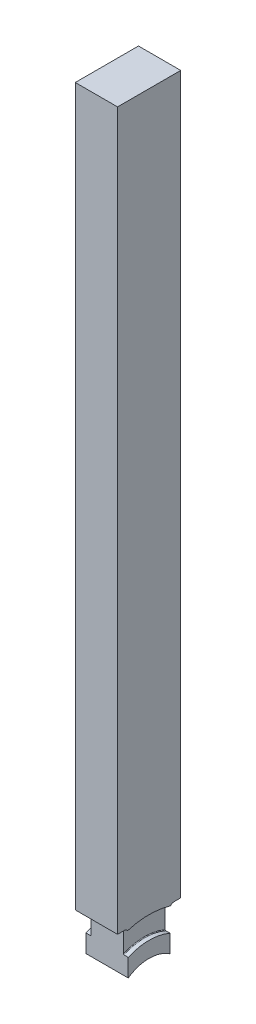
ISO-10303-21;
HEADER;
FILE_DESCRIPTION(('STEP AP214'),'2;1');
FILE_NAME('part.step','',(''),(''),'','','');
FILE_SCHEMA(('AUTOMOTIVE_DESIGN { 1 0 10303 214 1 1 1 1 }'));
ENDSEC;
DATA;
#1=APPLICATION_CONTEXT('core data for automotive mechanical design processes');
#2=APPLICATION_PROTOCOL_DEFINITION('international standard','automotive_design',2000,#1);
#3=PRODUCT_CONTEXT('',#1,'mechanical');
#4=PRODUCT('Part','Part','',(#3));
#5=PRODUCT_RELATED_PRODUCT_CATEGORY('part','',(#4));
#6=PRODUCT_DEFINITION_FORMATION('','',#4);
#7=PRODUCT_DEFINITION_CONTEXT('part definition',#1,'design');
#8=PRODUCT_DEFINITION('design','',#6,#7);
#9=PRODUCT_DEFINITION_SHAPE('','',#8);
#10=(LENGTH_UNIT() NAMED_UNIT(*) SI_UNIT(.MILLI.,.METRE.));
#11=(NAMED_UNIT(*) PLANE_ANGLE_UNIT() SI_UNIT($,.RADIAN.));
#12=(NAMED_UNIT(*) SI_UNIT($,.STERADIAN.) SOLID_ANGLE_UNIT());
#13=UNCERTAINTY_MEASURE_WITH_UNIT(LENGTH_MEASURE(1.E-05),#10,'distance_accuracy_value','');
#14=(GEOMETRIC_REPRESENTATION_CONTEXT(3) GLOBAL_UNCERTAINTY_ASSIGNED_CONTEXT((#13)) GLOBAL_UNIT_ASSIGNED_CONTEXT((#10,
#11,#12)) REPRESENTATION_CONTEXT('',''));
#15=CARTESIAN_POINT('',(0.,0.,0.));
#16=DIRECTION('',(0.,0.,1.));
#17=DIRECTION('',(1.,0.,0.));
#18=AXIS2_PLACEMENT_3D('',#15,#16,#17);
#19=CARTESIAN_POINT('',(12.827,479.425,19.177));
#20=DIRECTION('',(0.,0.,-1.));
#21=DIRECTION('',(0.,1.,0.));
#22=AXIS2_PLACEMENT_3D('',#19,#20,#21);
#23=PLANE('',#22);
#24=DIRECTION('',(0.,-1.,0.));
#25=VECTOR('',#24,1.);
#26=CARTESIAN_POINT('',(-12.827,479.425,19.177));
#27=LINE('',#26,#25);
#28=CARTESIAN_POINT('',(-12.827,479.425,19.177));
#29=VERTEX_POINT('',#28);
#30=CARTESIAN_POINT('',(-12.8270000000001,44.4246,19.177));
#31=VERTEX_POINT('',#30);
#32=EDGE_CURVE('E317',#29,#31,#27,.T.);
#33=ORIENTED_EDGE('',*,*,#32,.T.);
#34=DIRECTION('',(1.,0.,0.));
#35=VECTOR('',#34,1.);
#36=CARTESIAN_POINT('',(12.827,44.4246,19.177));
#37=LINE('',#36,#35);
#38=CARTESIAN_POINT('',(12.8270000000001,44.4246,19.177));
#39=VERTEX_POINT('',#38);
#40=EDGE_CURVE('E284',#31,#39,#37,.T.);
#41=ORIENTED_EDGE('',*,*,#40,.T.);
#42=DIRECTION('',(0.,-1.,0.));
#43=VECTOR('',#42,1.);
#44=CARTESIAN_POINT('',(12.827,479.425,19.177));
#45=LINE('',#44,#43);
#46=CARTESIAN_POINT('',(12.827,479.425,19.177));
#47=VERTEX_POINT('',#46);
#48=EDGE_CURVE('E308',#47,#39,#45,.T.);
#49=ORIENTED_EDGE('',*,*,#48,.F.);
#50=DIRECTION('',(-1.,0.,0.));
#51=VECTOR('',#50,1.);
#52=CARTESIAN_POINT('',(12.827,479.425,19.177));
#53=LINE('',#52,#51);
#54=EDGE_CURVE('E323',#47,#29,#53,.T.);
#55=ORIENTED_EDGE('',*,*,#54,.T.);
#56=EDGE_LOOP('',(#33,#41,#49,#55));
#57=FACE_BOUND('',#56,.T.);
#58=ADVANCED_FACE('F37',(#57),#23,.F.);
#59=CARTESIAN_POINT('',(12.827,479.425,-19.177));
#60=DIRECTION('',(0.,0.,1.));
#61=DIRECTION('',(0.,-1.,0.));
#62=AXIS2_PLACEMENT_3D('',#59,#60,#61);
#63=PLANE('',#62);
#64=DIRECTION('',(0.,1.,0.));
#65=VECTOR('',#64,1.);
#66=CARTESIAN_POINT('',(12.827,479.425,-19.177));
#67=LINE('',#66,#65);
#68=CARTESIAN_POINT('',(12.8270000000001,44.4246,-19.177));
#69=VERTEX_POINT('',#68);
#70=CARTESIAN_POINT('',(12.827,479.425,-19.177));
#71=VERTEX_POINT('',#70);
#72=EDGE_CURVE('E312',#69,#71,#67,.T.);
#73=ORIENTED_EDGE('',*,*,#72,.F.);
#74=DIRECTION('',(-1.,0.,0.));
#75=VECTOR('',#74,1.);
#76=CARTESIAN_POINT('',(12.827,44.4246,-19.177));
#77=LINE('',#76,#75);
#78=CARTESIAN_POINT('',(-12.8270000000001,44.4246,-19.177));
#79=VERTEX_POINT('',#78);
#80=EDGE_CURVE('E196',#69,#79,#77,.T.);
#81=ORIENTED_EDGE('',*,*,#80,.T.);
#82=DIRECTION('',(0.,1.,0.));
#83=VECTOR('',#82,1.);
#84=CARTESIAN_POINT('',(-12.827,479.425,-19.177));
#85=LINE('',#84,#83);
#86=CARTESIAN_POINT('',(-12.827,479.425,-19.177));
#87=VERTEX_POINT('',#86);
#88=EDGE_CURVE('E309',#79,#87,#85,.T.);
#89=ORIENTED_EDGE('',*,*,#88,.T.);
#90=DIRECTION('',(-1.,0.,0.));
#91=VECTOR('',#90,1.);
#92=CARTESIAN_POINT('',(12.827,479.425,-19.177));
#93=LINE('',#92,#91);
#94=EDGE_CURVE('E314',#71,#87,#93,.T.);
#95=ORIENTED_EDGE('',*,*,#94,.F.);
#96=EDGE_LOOP('',(#73,#81,#89,#95));
#97=FACE_BOUND('',#96,.T.);
#98=ADVANCED_FACE('F435',(#97),#63,.F.);
#99=CARTESIAN_POINT('',(12.827,0.,0.));
#100=DIRECTION('',(-1.,0.,0.));
#101=DIRECTION('',(0.,0.,1.));
#102=AXIS2_PLACEMENT_3D('',#99,#100,#101);
#103=PLANE('',#102);
#104=CARTESIAN_POINT('',(12.827,0.,0.));
#105=DIRECTION('',(1.,0.,0.));
#106=DIRECTION('',(0.,0.,-1.));
#107=AXIS2_PLACEMENT_3D('',#104,#105,#106);
#108=CIRCLE('',#107,22.225);
#109=CARTESIAN_POINT('',(12.8270000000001,18.2389864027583,-12.7));
#110=VERTEX_POINT('',#109);
#111=CARTESIAN_POINT('',(12.8270000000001,18.2389864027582,12.7));
#112=VERTEX_POINT('',#111);
#113=EDGE_CURVE('E294',#110,#112,#108,.T.);
#114=ORIENTED_EDGE('',*,*,#113,.F.);
#115=DIRECTION('',(0.,-1.,0.));
#116=VECTOR('',#115,1.);
#117=CARTESIAN_POINT('',(12.8270000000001,0.,-12.7));
#118=LINE('',#117,#116);
#119=CARTESIAN_POINT('',(12.8270000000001,29.0993556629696,-12.7));
#120=VERTEX_POINT('',#119);
#121=EDGE_CURVE('E201',#120,#110,#118,.T.);
#122=ORIENTED_EDGE('',*,*,#121,.F.);
#123=CARTESIAN_POINT('',(12.8270000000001,0.,0.));
#124=DIRECTION('',(-1.,0.,0.));
#125=DIRECTION('',(0.,0.,1.));
#126=AXIS2_PLACEMENT_3D('',#123,#124,#125);
#127=CIRCLE('',#126,31.75);
#128=CARTESIAN_POINT('',(12.8270000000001,29.0993556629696,12.7));
#129=VERTEX_POINT('',#128);
#130=EDGE_CURVE('E290',#129,#120,#127,.T.);
#131=ORIENTED_EDGE('',*,*,#130,.F.);
#132=DIRECTION('',(0.,1.,0.));
#133=VECTOR('',#132,1.);
#134=CARTESIAN_POINT('',(12.8270000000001,0.,12.7));
#135=LINE('',#134,#133);
#136=EDGE_CURVE('E234',#112,#129,#135,.T.);
#137=ORIENTED_EDGE('',*,*,#136,.F.);
#138=EDGE_LOOP('',(#114,#122,#131,#137));
#139=FACE_BOUND('',#138,.T.);
#140=ADVANCED_FACE('F429',(#139),#103,.F.);
#141=CARTESIAN_POINT('',(-12.827,0.,0.));
#142=DIRECTION('',(-1.,0.,0.));
#143=DIRECTION('',(0.,0.,1.));
#144=AXIS2_PLACEMENT_3D('',#141,#142,#143);
#145=PLANE('',#144);
#146=CARTESIAN_POINT('',(-12.8270000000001,42.037,-15.0876));
#147=DIRECTION('',(1.,0.,0.));
#148=DIRECTION('',(0.,0.,1.));
#149=AXIS2_PLACEMENT_3D('',#146,#147,#148);
#150=CIRCLE('',#149,2.3876);
#151=CARTESIAN_POINT('',(-12.8270000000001,44.4246,-15.0876));
#152=VERTEX_POINT('',#151);
#153=CARTESIAN_POINT('',(-12.8270000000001,43.3090510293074,-13.0670753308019));
#154=VERTEX_POINT('',#153);
#155=EDGE_CURVE('E209',#152,#154,#150,.T.);
#156=ORIENTED_EDGE('',*,*,#155,.T.);
#157=CARTESIAN_POINT('',(-12.8270000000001,0.,0.));
#158=DIRECTION('',(-1.,0.,0.));
#159=DIRECTION('',(0.,0.,1.));
#160=AXIS2_PLACEMENT_3D('',#157,#158,#159);
#161=CIRCLE('',#160,45.2374);
#162=CARTESIAN_POINT('',(-12.8270000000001,43.3090510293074,13.0670753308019));
#163=VERTEX_POINT('',#162);
#164=EDGE_CURVE('E291',#163,#154,#161,.T.);
#165=ORIENTED_EDGE('',*,*,#164,.F.);
#166=CARTESIAN_POINT('',(-12.8270000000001,42.037,15.0876));
#167=DIRECTION('',(1.,0.,0.));
#168=DIRECTION('',(0.,0.,-1.));
#169=AXIS2_PLACEMENT_3D('',#166,#167,#168);
#170=CIRCLE('',#169,2.3876);
#171=CARTESIAN_POINT('',(-12.8270000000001,44.4246,15.0876));
#172=VERTEX_POINT('',#171);
#173=EDGE_CURVE('E236',#163,#172,#170,.T.);
#174=ORIENTED_EDGE('',*,*,#173,.T.);
#175=DIRECTION('',(0.,0.,1.));
#176=VECTOR('',#175,1.);
#177=CARTESIAN_POINT('',(-12.8270000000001,44.4246,15.0876));
#178=LINE('',#177,#176);
#179=EDGE_CURVE('E239',#172,#31,#178,.T.);
#180=ORIENTED_EDGE('',*,*,#179,.T.);
#181=ORIENTED_EDGE('',*,*,#32,.F.);
#182=DIRECTION('',(0.,0.,1.));
#183=VECTOR('',#182,1.);
#184=CARTESIAN_POINT('',(-12.827,479.425,19.177));
#185=LINE('',#184,#183);
#186=EDGE_CURVE('E304',#87,#29,#185,.T.);
#187=ORIENTED_EDGE('',*,*,#186,.F.);
#188=ORIENTED_EDGE('',*,*,#88,.F.);
#189=DIRECTION('',(0.,0.,1.));
#190=VECTOR('',#189,1.);
#191=CARTESIAN_POINT('',(-12.8270000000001,44.4246,-15.0876));
#192=LINE('',#191,#190);
#193=EDGE_CURVE('E221',#79,#152,#192,.T.);
#194=ORIENTED_EDGE('',*,*,#193,.T.);
#195=EDGE_LOOP('',(#156,#165,#174,#180,#181,#187,#188,#194));
#196=FACE_BOUND('',#195,.T.);
#197=ADVANCED_FACE('F430',(#196),#145,.T.);
#198=DIRECTION('',(0.,-1.,0.));
#199=VECTOR('',#198,1.);
#200=CARTESIAN_POINT('',(-12.8270000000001,0.,-12.7));
#201=LINE('',#200,#199);
#202=CARTESIAN_POINT('',(-12.8270000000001,29.0993556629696,-12.7));
#203=VERTEX_POINT('',#202);
#204=CARTESIAN_POINT('',(-12.8270000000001,18.2389864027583,-12.7));
#205=VERTEX_POINT('',#204);
#206=EDGE_CURVE('E218',#203,#205,#201,.T.);
#207=ORIENTED_EDGE('',*,*,#206,.T.);
#208=CARTESIAN_POINT('',(-12.827,0.,0.));
#209=DIRECTION('',(1.,0.,0.));
#210=DIRECTION('',(0.,0.,-1.));
#211=AXIS2_PLACEMENT_3D('',#208,#209,#210);
#212=CIRCLE('',#211,22.225);
#213=CARTESIAN_POINT('',(-12.8270000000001,18.2389864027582,12.7));
#214=VERTEX_POINT('',#213);
#215=EDGE_CURVE('E301',#205,#214,#212,.T.);
#216=ORIENTED_EDGE('',*,*,#215,.T.);
#217=DIRECTION('',(0.,1.,0.));
#218=VECTOR('',#217,1.);
#219=CARTESIAN_POINT('',(-12.8270000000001,0.,12.7));
#220=LINE('',#219,#218);
#221=CARTESIAN_POINT('',(-12.8270000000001,29.0993556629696,12.7));
#222=VERTEX_POINT('',#221);
#223=EDGE_CURVE('E242',#214,#222,#220,.T.);
#224=ORIENTED_EDGE('',*,*,#223,.T.);
#225=CARTESIAN_POINT('',(-12.8270000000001,0.,0.));
#226=DIRECTION('',(-1.,0.,0.));
#227=DIRECTION('',(0.,0.,1.));
#228=AXIS2_PLACEMENT_3D('',#225,#226,#227);
#229=CIRCLE('',#228,31.75);
#230=EDGE_CURVE('E288',#222,#203,#229,.T.);
#231=ORIENTED_EDGE('',*,*,#230,.T.);
#232=EDGE_LOOP('',(#207,#216,#224,#231));
#233=FACE_BOUND('',#232,.T.);
#234=ADVANCED_FACE('F433',(#233),#145,.T.);
#235=CARTESIAN_POINT('',(12.827,479.425,19.177));
#236=DIRECTION('',(0.,-1.,0.));
#237=DIRECTION('',(0.,0.,-1.));
#238=AXIS2_PLACEMENT_3D('',#235,#236,#237);
#239=PLANE('',#238);
#240=ORIENTED_EDGE('',*,*,#186,.T.);
#241=ORIENTED_EDGE('',*,*,#54,.F.);
#242=DIRECTION('',(0.,0.,1.));
#243=VECTOR('',#242,1.);
#244=CARTESIAN_POINT('',(12.827,479.425,19.177));
#245=LINE('',#244,#243);
#246=EDGE_CURVE('E305',#71,#47,#245,.T.);
#247=ORIENTED_EDGE('',*,*,#246,.F.);
#248=ORIENTED_EDGE('',*,*,#94,.T.);
#249=EDGE_LOOP('',(#240,#241,#247,#248));
#250=FACE_BOUND('',#249,.T.);
#251=ADVANCED_FACE('F368',(#250),#239,.F.);
#252=CARTESIAN_POINT('',(12.8270000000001,0.,0.));
#253=DIRECTION('',(-1.,0.,0.));
#254=DIRECTION('',(0.,0.,1.));
#255=AXIS2_PLACEMENT_3D('',#252,#253,#254);
#256=CIRCLE('',#255,45.2374);
#257=CARTESIAN_POINT('',(12.8270000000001,43.3090510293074,13.0670753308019));
#258=VERTEX_POINT('',#257);
#259=CARTESIAN_POINT('',(12.8270000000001,43.3090510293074,-13.0670753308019));
#260=VERTEX_POINT('',#259);
#261=EDGE_CURVE('E217',#258,#260,#256,.T.);
#262=ORIENTED_EDGE('',*,*,#261,.T.);
#263=CARTESIAN_POINT('',(12.8270000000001,42.037,-15.0876));
#264=DIRECTION('',(1.,0.,0.));
#265=DIRECTION('',(0.,0.,1.));
#266=AXIS2_PLACEMENT_3D('',#263,#264,#265);
#267=CIRCLE('',#266,2.3876);
#268=CARTESIAN_POINT('',(12.8270000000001,44.4246,-15.0876));
#269=VERTEX_POINT('',#268);
#270=EDGE_CURVE('E200',#269,#260,#267,.T.);
#271=ORIENTED_EDGE('',*,*,#270,.F.);
#272=DIRECTION('',(0.,0.,1.));
#273=VECTOR('',#272,1.);
#274=CARTESIAN_POINT('',(12.8270000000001,44.4246,-15.0876));
#275=LINE('',#274,#273);
#276=EDGE_CURVE('E190',#69,#269,#275,.T.);
#277=ORIENTED_EDGE('',*,*,#276,.F.);
#278=ORIENTED_EDGE('',*,*,#72,.T.);
#279=ORIENTED_EDGE('',*,*,#246,.T.);
#280=ORIENTED_EDGE('',*,*,#48,.T.);
#281=DIRECTION('',(0.,0.,1.));
#282=VECTOR('',#281,1.);
#283=CARTESIAN_POINT('',(12.8270000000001,44.4246,15.0876));
#284=LINE('',#283,#282);
#285=CARTESIAN_POINT('',(12.8270000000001,44.4246,15.0876));
#286=VERTEX_POINT('',#285);
#287=EDGE_CURVE('E232',#286,#39,#284,.T.);
#288=ORIENTED_EDGE('',*,*,#287,.F.);
#289=CARTESIAN_POINT('',(12.8270000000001,42.037,15.0876));
#290=DIRECTION('',(1.,0.,0.));
#291=DIRECTION('',(0.,0.,-1.));
#292=AXIS2_PLACEMENT_3D('',#289,#290,#291);
#293=CIRCLE('',#292,2.3876);
#294=EDGE_CURVE('E230',#258,#286,#293,.T.);
#295=ORIENTED_EDGE('',*,*,#294,.F.);
#296=EDGE_LOOP('',(#262,#271,#277,#278,#279,#280,#288,#295));
#297=FACE_BOUND('',#296,.T.);
#298=ADVANCED_FACE('F214',(#297),#103,.F.);
#299=CARTESIAN_POINT('',(-12.827,0.,0.));
#300=DIRECTION('',(1.,0.,0.));
#301=DIRECTION('',(0.,0.,-1.));
#302=AXIS2_PLACEMENT_3D('',#299,#300,#301);
#303=CYLINDRICAL_SURFACE('',#302,22.225);
#304=ORIENTED_EDGE('',*,*,#215,.F.);
#305=DIRECTION('',(1.,0.,0.));
#306=VECTOR('',#305,1.);
#307=CARTESIAN_POINT('',(-12.827,18.2389864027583,-12.7));
#308=LINE('',#307,#306);
#309=EDGE_CURVE('E281',#205,#110,#308,.T.);
#310=ORIENTED_EDGE('',*,*,#309,.T.);
#311=ORIENTED_EDGE('',*,*,#113,.T.);
#312=DIRECTION('',(1.,0.,0.));
#313=VECTOR('',#312,1.);
#314=CARTESIAN_POINT('',(-12.827,18.2389864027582,12.7));
#315=LINE('',#314,#313);
#316=EDGE_CURVE('E271',#112,#214,#315,.F.);
#317=ORIENTED_EDGE('',*,*,#316,.T.);
#318=EDGE_LOOP('',(#304,#310,#311,#317));
#319=FACE_BOUND('',#318,.T.);
#320=ADVANCED_FACE('F416',(#319),#303,.F.);
#321=CARTESIAN_POINT('',(-9.85520000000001,31.75,0.));
#322=DIRECTION('',(-1.,0.,0.));
#323=DIRECTION('',(0.,0.,1.));
#324=AXIS2_PLACEMENT_3D('',#321,#322,#323);
#325=PLANE('',#324);
#326=DIRECTION('',(0.,1.,0.));
#327=VECTOR('',#326,1.);
#328=CARTESIAN_POINT('',(-9.85520000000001,31.75,-12.7));
#329=LINE('',#328,#327);
#330=CARTESIAN_POINT('',(-9.85520000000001,29.5145923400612,-12.7));
#331=VERTEX_POINT('',#330);
#332=CARTESIAN_POINT('',(-9.85520000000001,42.037,-12.7));
#333=VERTEX_POINT('',#332);
#334=EDGE_CURVE('E279',#331,#333,#329,.T.);
#335=ORIENTED_EDGE('',*,*,#334,.F.);
#336=CARTESIAN_POINT('',(-9.85520000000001,0.,0.));
#337=DIRECTION('',(-1.,0.,0.));
#338=DIRECTION('',(0.,0.,1.));
#339=AXIS2_PLACEMENT_3D('',#336,#337,#338);
#340=CIRCLE('',#339,32.131);
#341=CARTESIAN_POINT('',(-9.85520000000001,29.5145923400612,12.7));
#342=VERTEX_POINT('',#341);
#343=EDGE_CURVE('E474',#331,#342,#340,.F.);
#344=ORIENTED_EDGE('',*,*,#343,.T.);
#345=DIRECTION('',(0.,-1.,0.));
#346=VECTOR('',#345,1.);
#347=CARTESIAN_POINT('',(-9.85520000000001,31.75,12.7));
#348=LINE('',#347,#346);
#349=CARTESIAN_POINT('',(-9.85520000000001,42.037,12.7));
#350=VERTEX_POINT('',#349);
#351=EDGE_CURVE('E268',#350,#342,#348,.T.);
#352=ORIENTED_EDGE('',*,*,#351,.F.);
#353=CARTESIAN_POINT('',(-9.85520000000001,42.037,15.0876));
#354=DIRECTION('',(-1.,0.,0.));
#355=DIRECTION('',(0.,0.,1.));
#356=AXIS2_PLACEMENT_3D('',#353,#354,#355);
#357=CIRCLE('',#356,2.3876);
#358=CARTESIAN_POINT('',(-9.85520000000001,42.6032439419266,12.7681169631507));
#359=VERTEX_POINT('',#358);
#360=EDGE_CURVE('E256',#359,#350,#357,.T.);
#361=ORIENTED_EDGE('',*,*,#360,.F.);
#362=CARTESIAN_POINT('',(-9.85520000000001,0.,0.));
#363=DIRECTION('',(-1.,0.,0.));
#364=DIRECTION('',(0.,0.,1.));
#365=AXIS2_PLACEMENT_3D('',#362,#363,#364);
#366=CIRCLE('',#365,44.4754);
#367=CARTESIAN_POINT('',(-9.85520000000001,42.6032439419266,-12.7681169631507));
#368=VERTEX_POINT('',#367);
#369=EDGE_CURVE('E334',#359,#368,#366,.T.);
#370=ORIENTED_EDGE('',*,*,#369,.T.);
#371=CARTESIAN_POINT('',(-9.85520000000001,42.037,-15.0876));
#372=DIRECTION('',(-1.,0.,0.));
#373=DIRECTION('',(0.,0.,1.));
#374=AXIS2_PLACEMENT_3D('',#371,#372,#373);
#375=CIRCLE('',#374,2.3876);
#376=EDGE_CURVE('E262',#333,#368,#375,.T.);
#377=ORIENTED_EDGE('',*,*,#376,.F.);
#378=EDGE_LOOP('',(#335,#344,#352,#361,#370,#377));
#379=FACE_BOUND('',#378,.T.);
#380=ADVANCED_FACE('F412',(#379),#325,.T.);
#381=CARTESIAN_POINT('',(-8.84822894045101,0.,0.));
#382=DIRECTION('',(-1.,0.,0.));
#383=DIRECTION('',(0.,0.,1.));
#384=AXIS2_PLACEMENT_3D('',#381,#382,#383);
#385=CYLINDRICAL_SURFACE('',#384,45.2374);
#386=DIRECTION('',(1.,0.,0.));
#387=VECTOR('',#386,1.);
#388=CARTESIAN_POINT('',(-11.3411,43.3090510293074,-13.0670753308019));
#389=LINE('',#388,#387);
#390=CARTESIAN_POINT('',(-10.6172,43.3090510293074,-13.0670753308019));
#391=VERTEX_POINT('',#390);
#392=EDGE_CURVE('E260',#391,#154,#389,.F.);
#393=ORIENTED_EDGE('',*,*,#392,.F.);
#394=CARTESIAN_POINT('',(-10.6172,0.,0.));
#395=DIRECTION('',(-1.,0.,0.));
#396=DIRECTION('',(0.,0.,1.));
#397=AXIS2_PLACEMENT_3D('',#394,#395,#396);
#398=CIRCLE('',#397,45.2374);
#399=CARTESIAN_POINT('',(-10.6172,43.3090510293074,13.0670753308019));
#400=VERTEX_POINT('',#399);
#401=EDGE_CURVE('E337',#391,#400,#398,.F.);
#402=ORIENTED_EDGE('',*,*,#401,.T.);
#403=DIRECTION('',(1.,0.,0.));
#404=VECTOR('',#403,1.);
#405=CARTESIAN_POINT('',(-11.3411,43.3090510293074,13.0670753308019));
#406=LINE('',#405,#404);
#407=EDGE_CURVE('E253',#163,#400,#406,.T.);
#408=ORIENTED_EDGE('',*,*,#407,.F.);
#409=ORIENTED_EDGE('',*,*,#164,.T.);
#410=EDGE_LOOP('',(#393,#402,#408,#409));
#411=FACE_BOUND('',#410,.T.);
#412=ADVANCED_FACE('F415',(#411),#385,.F.);
#413=CARTESIAN_POINT('',(-8.84822894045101,0.,0.));
#414=DIRECTION('',(-1.,0.,0.));
#415=DIRECTION('',(0.,0.,1.));
#416=AXIS2_PLACEMENT_3D('',#413,#414,#415);
#417=CYLINDRICAL_SURFACE('',#416,31.75);
#418=DIRECTION('',(-1.,0.,0.));
#419=VECTOR('',#418,1.);
#420=CARTESIAN_POINT('',(-8.84822894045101,29.0993556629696,12.7));
#421=LINE('',#420,#419);
#422=CARTESIAN_POINT('',(-10.2362,29.0993556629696,12.7));
#423=VERTEX_POINT('',#422);
#424=EDGE_CURVE('E266',#423,#222,#421,.T.);
#425=ORIENTED_EDGE('',*,*,#424,.F.);
#426=CARTESIAN_POINT('',(-10.2362,0.,0.));
#427=DIRECTION('',(-1.,0.,0.));
#428=DIRECTION('',(0.,0.,1.));
#429=AXIS2_PLACEMENT_3D('',#426,#427,#428);
#430=CIRCLE('',#429,31.75);
#431=CARTESIAN_POINT('',(-10.2362,29.0993556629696,-12.7));
#432=VERTEX_POINT('',#431);
#433=EDGE_CURVE('E389',#423,#432,#430,.T.);
#434=ORIENTED_EDGE('',*,*,#433,.T.);
#435=DIRECTION('',(-1.,0.,0.));
#436=VECTOR('',#435,1.);
#437=CARTESIAN_POINT('',(-8.84822894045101,29.0993556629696,-12.7));
#438=LINE('',#437,#436);
#439=EDGE_CURVE('E276',#203,#432,#438,.F.);
#440=ORIENTED_EDGE('',*,*,#439,.F.);
#441=ORIENTED_EDGE('',*,*,#230,.F.);
#442=EDGE_LOOP('',(#425,#434,#440,#441));
#443=FACE_BOUND('',#442,.T.);
#444=ADVANCED_FACE('F408',(#443),#417,.T.);
#445=CARTESIAN_POINT('',(9.8552,31.75,0.));
#446=DIRECTION('',(1.,0.,0.));
#447=DIRECTION('',(0.,0.,-1.));
#448=AXIS2_PLACEMENT_3D('',#445,#446,#447);
#449=PLANE('',#448);
#450=DIRECTION('',(0.,1.,0.));
#451=VECTOR('',#450,1.);
#452=CARTESIAN_POINT('',(9.8552,31.75,12.7));
#453=LINE('',#452,#451);
#454=CARTESIAN_POINT('',(9.8552,29.5145923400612,12.7));
#455=VERTEX_POINT('',#454);
#456=CARTESIAN_POINT('',(9.8552,42.037,12.7));
#457=VERTEX_POINT('',#456);
#458=EDGE_CURVE('E264',#455,#457,#453,.T.);
#459=ORIENTED_EDGE('',*,*,#458,.F.);
#460=CARTESIAN_POINT('',(9.8552,0.,0.));
#461=DIRECTION('',(1.,0.,0.));
#462=DIRECTION('',(0.,0.,-1.));
#463=AXIS2_PLACEMENT_3D('',#460,#461,#462);
#464=CIRCLE('',#463,32.131);
#465=CARTESIAN_POINT('',(9.8552,29.5145923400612,-12.7));
#466=VERTEX_POINT('',#465);
#467=EDGE_CURVE('E470',#455,#466,#464,.F.);
#468=ORIENTED_EDGE('',*,*,#467,.T.);
#469=DIRECTION('',(0.,-1.,0.));
#470=VECTOR('',#469,1.);
#471=CARTESIAN_POINT('',(9.8552,31.75,-12.7));
#472=LINE('',#471,#470);
#473=CARTESIAN_POINT('',(9.8552,42.037,-12.7));
#474=VERTEX_POINT('',#473);
#475=EDGE_CURVE('E274',#474,#466,#472,.T.);
#476=ORIENTED_EDGE('',*,*,#475,.F.);
#477=CARTESIAN_POINT('',(9.8552,42.037,-15.0876));
#478=DIRECTION('',(1.,0.,0.));
#479=DIRECTION('',(0.,0.,-1.));
#480=AXIS2_PLACEMENT_3D('',#477,#478,#479);
#481=CIRCLE('',#480,2.3876);
#482=CARTESIAN_POINT('',(9.8552,42.6032439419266,-12.7681169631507));
#483=VERTEX_POINT('',#482);
#484=EDGE_CURVE('E258',#483,#474,#481,.T.);
#485=ORIENTED_EDGE('',*,*,#484,.F.);
#486=CARTESIAN_POINT('',(9.8552,0.,0.));
#487=DIRECTION('',(1.,0.,0.));
#488=DIRECTION('',(0.,0.,-1.));
#489=AXIS2_PLACEMENT_3D('',#486,#487,#488);
#490=CIRCLE('',#489,44.4754);
#491=CARTESIAN_POINT('',(9.8552,42.6032439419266,12.7681169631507));
#492=VERTEX_POINT('',#491);
#493=EDGE_CURVE('E342',#483,#492,#490,.T.);
#494=ORIENTED_EDGE('',*,*,#493,.T.);
#495=CARTESIAN_POINT('',(9.8552,42.037,15.0876));
#496=DIRECTION('',(1.,0.,0.));
#497=DIRECTION('',(0.,0.,-1.));
#498=AXIS2_PLACEMENT_3D('',#495,#496,#497);
#499=CIRCLE('',#498,2.3876);
#500=EDGE_CURVE('E228',#457,#492,#499,.T.);
#501=ORIENTED_EDGE('',*,*,#500,.F.);
#502=EDGE_LOOP('',(#459,#468,#476,#485,#494,#501));
#503=FACE_BOUND('',#502,.T.);
#504=ADVANCED_FACE('F405',(#503),#449,.T.);
#505=CARTESIAN_POINT('',(-8.84822894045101,0.,0.));
#506=DIRECTION('',(-1.,0.,0.));
#507=DIRECTION('',(0.,0.,1.));
#508=AXIS2_PLACEMENT_3D('',#505,#506,#507);
#509=CYLINDRICAL_SURFACE('',#508,31.75);
#510=DIRECTION('',(-1.,0.,0.));
#511=VECTOR('',#510,1.);
#512=CARTESIAN_POINT('',(-8.84822894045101,29.0993556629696,-12.7));
#513=LINE('',#512,#511);
#514=CARTESIAN_POINT('',(10.2362,29.0993556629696,-12.7));
#515=VERTEX_POINT('',#514);
#516=EDGE_CURVE('E332',#515,#120,#513,.F.);
#517=ORIENTED_EDGE('',*,*,#516,.F.);
#518=CARTESIAN_POINT('',(10.2362,0.,0.));
#519=DIRECTION('',(1.,0.,0.));
#520=DIRECTION('',(0.,0.,-1.));
#521=AXIS2_PLACEMENT_3D('',#518,#519,#520);
#522=CIRCLE('',#521,31.75);
#523=CARTESIAN_POINT('',(10.2362,29.0993556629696,12.7));
#524=VERTEX_POINT('',#523);
#525=EDGE_CURVE('E58',#515,#524,#522,.T.);
#526=ORIENTED_EDGE('',*,*,#525,.T.);
#527=DIRECTION('',(-1.,0.,0.));
#528=VECTOR('',#527,1.);
#529=CARTESIAN_POINT('',(-8.84822894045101,29.0993556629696,12.7));
#530=LINE('',#529,#528);
#531=EDGE_CURVE('E330',#129,#524,#530,.T.);
#532=ORIENTED_EDGE('',*,*,#531,.F.);
#533=ORIENTED_EDGE('',*,*,#130,.T.);
#534=EDGE_LOOP('',(#517,#526,#532,#533));
#535=FACE_BOUND('',#534,.T.);
#536=ADVANCED_FACE('F403',(#535),#509,.T.);
#537=CARTESIAN_POINT('',(-8.84822894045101,0.,0.));
#538=DIRECTION('',(-1.,0.,0.));
#539=DIRECTION('',(0.,0.,1.));
#540=AXIS2_PLACEMENT_3D('',#537,#538,#539);
#541=CYLINDRICAL_SURFACE('',#540,45.2374);
#542=DIRECTION('',(1.,0.,0.));
#543=VECTOR('',#542,1.);
#544=CARTESIAN_POINT('',(0.,43.3090510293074,13.0670753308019));
#545=LINE('',#544,#543);
#546=CARTESIAN_POINT('',(10.6172,43.3090510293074,13.0670753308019));
#547=VERTEX_POINT('',#546);
#548=EDGE_CURVE('E326',#547,#258,#545,.T.);
#549=ORIENTED_EDGE('',*,*,#548,.F.);
#550=CARTESIAN_POINT('',(10.6172,0.,0.));
#551=DIRECTION('',(1.,0.,0.));
#552=DIRECTION('',(0.,0.,-1.));
#553=AXIS2_PLACEMENT_3D('',#550,#551,#552);
#554=CIRCLE('',#553,45.2374);
#555=CARTESIAN_POINT('',(10.6172,43.3090510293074,-13.0670753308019));
#556=VERTEX_POINT('',#555);
#557=EDGE_CURVE('E339',#547,#556,#554,.F.);
#558=ORIENTED_EDGE('',*,*,#557,.T.);
#559=DIRECTION('',(1.,0.,0.));
#560=VECTOR('',#559,1.);
#561=CARTESIAN_POINT('',(0.,43.3090510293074,-13.0670753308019));
#562=LINE('',#561,#560);
#563=EDGE_CURVE('E328',#260,#556,#562,.F.);
#564=ORIENTED_EDGE('',*,*,#563,.F.);
#565=ORIENTED_EDGE('',*,*,#261,.F.);
#566=EDGE_LOOP('',(#549,#558,#564,#565));
#567=FACE_BOUND('',#566,.T.);
#568=ADVANCED_FACE('F399',(#567),#541,.F.);
#569=CARTESIAN_POINT('',(-12.8270000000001,44.4246,15.0876));
#570=DIRECTION('',(0.,1.,0.));
#571=DIRECTION('',(0.,0.,1.));
#572=AXIS2_PLACEMENT_3D('',#569,#570,#571);
#573=PLANE('',#572);
#574=ORIENTED_EDGE('',*,*,#179,.F.);
#575=DIRECTION('',(1.,0.,0.));
#576=VECTOR('',#575,1.);
#577=CARTESIAN_POINT('',(-12.8270000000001,44.4246,15.0876));
#578=LINE('',#577,#576);
#579=EDGE_CURVE('E245',#172,#286,#578,.T.);
#580=ORIENTED_EDGE('',*,*,#579,.T.);
#581=ORIENTED_EDGE('',*,*,#287,.T.);
#582=ORIENTED_EDGE('',*,*,#40,.F.);
#583=EDGE_LOOP('',(#574,#580,#581,#582));
#584=FACE_BOUND('',#583,.T.);
#585=ADVANCED_FACE('F398',(#584),#573,.F.);
#586=CARTESIAN_POINT('',(-12.8270000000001,0.,12.7));
#587=DIRECTION('',(0.,0.,-1.));
#588=DIRECTION('',(0.,1.,0.));
#589=AXIS2_PLACEMENT_3D('',#586,#587,#588);
#590=PLANE('',#589);
#591=ORIENTED_EDGE('',*,*,#136,.T.);
#592=ORIENTED_EDGE('',*,*,#531,.T.);
#593=CARTESIAN_POINT('',(10.2362,29.0993556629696,12.7));
#594=CARTESIAN_POINT('',(10.2160442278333,29.0993303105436,12.7));
#595=CARTESIAN_POINT('',(10.1959043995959,29.1010990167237,12.7));
#596=CARTESIAN_POINT('',(10.1562770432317,29.1080244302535,12.7));
#597=CARTESIAN_POINT('',(10.1367877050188,29.1131707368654,12.7));
#598=CARTESIAN_POINT('',(10.0989580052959,29.1266510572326,12.7));
#599=CARTESIAN_POINT('',(10.0806172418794,29.1349839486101,12.7));
#600=CARTESIAN_POINT('',(10.0455248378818,29.154510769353,12.7));
#601=CARTESIAN_POINT('',(10.0287739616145,29.1657060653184,12.7));
#602=CARTESIAN_POINT('',(9.99668843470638,29.1910002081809,12.7));
#603=CARTESIAN_POINT('',(9.98142212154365,29.2051855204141,12.7));
#604=CARTESIAN_POINT('',(9.95327515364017,29.2357483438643,12.7));
#605=CARTESIAN_POINT('',(9.94039510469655,29.2521264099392,12.7));
#606=CARTESIAN_POINT('',(9.91630689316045,29.2879834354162,12.7));
#607=CARTESIAN_POINT('',(9.90531143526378,29.3076051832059,12.7));
#608=CARTESIAN_POINT('',(9.88649650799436,29.3483221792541,12.7));
#609=CARTESIAN_POINT('',(9.87867867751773,29.3694181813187,12.7));
#610=CARTESIAN_POINT('',(9.86674874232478,29.4110601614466,12.7));
#611=CARTESIAN_POINT('',(9.86241896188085,29.4315443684,12.7));
#612=CARTESIAN_POINT('',(9.85664464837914,29.472883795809,12.7));
#613=CARTESIAN_POINT('',(9.85519568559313,29.4937383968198,12.7));
#614=CARTESIAN_POINT('',(9.8552,29.5145923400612,12.7));
#615=B_SPLINE_CURVE_WITH_KNOTS('',3,(#593,#594,#595,#596,#597,#598,#599,#600,#601,#602,#603,
#604,#605,#606,#607,#608,#609,#610,#611,#612,#613,#614),.UNSPECIFIED.,.F.,.F.,(4,2,2,2,2,2,2,2,
2,2,4),(0.,0.0603650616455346,0.120545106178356,0.180703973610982,0.240891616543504,
0.303144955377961,0.365414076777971,0.432606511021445,0.499833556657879,0.562442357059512,
0.624954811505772),.UNSPECIFIED.);
#616=EDGE_CURVE('E11',#524,#455,#615,.T.);
#617=ORIENTED_EDGE('',*,*,#616,.T.);
#618=ORIENTED_EDGE('',*,*,#458,.T.);
#619=DIRECTION('',(1.,0.,0.));
#620=VECTOR('',#619,1.);
#621=CARTESIAN_POINT('',(-12.8270000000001,42.037,12.7));
#622=LINE('',#621,#620);
#623=EDGE_CURVE('E246',#350,#457,#622,.T.);
#624=ORIENTED_EDGE('',*,*,#623,.F.);
#625=ORIENTED_EDGE('',*,*,#351,.T.);
#626=CARTESIAN_POINT('',(-9.85520000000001,29.5145923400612,12.7));
#627=CARTESIAN_POINT('',(-9.85518967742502,29.4896301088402,12.7));
#628=CARTESIAN_POINT('',(-9.85726978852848,29.4646614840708,12.7));
#629=CARTESIAN_POINT('',(-9.86554425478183,29.4153652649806,12.7));
#630=CARTESIAN_POINT('',(-9.87174683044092,29.3910390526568,12.7));
#631=CARTESIAN_POINT('',(-9.88821000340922,29.3437555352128,12.7));
#632=CARTESIAN_POINT('',(-9.89847598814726,29.3208000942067,12.7));
#633=CARTESIAN_POINT('',(-9.92288445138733,29.2770659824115,12.7));
#634=CARTESIAN_POINT('',(-9.93702329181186,29.2562852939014,12.7));
#635=CARTESIAN_POINT('',(-9.96816546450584,29.2185435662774,12.7));
#636=CARTESIAN_POINT('',(-9.9850106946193,29.201452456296,12.7));
#637=CARTESIAN_POINT('',(-10.0215723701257,29.1706560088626,12.7));
#638=CARTESIAN_POINT('',(-10.0412883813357,29.1569501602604,12.7));
#639=CARTESIAN_POINT('',(-10.0812215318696,29.1345759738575,12.7));
#640=CARTESIAN_POINT('',(-10.1012553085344,29.1255796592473,12.7));
#641=CARTESIAN_POINT('',(-10.1426125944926,29.1114017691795,12.7));
#642=CARTESIAN_POINT('',(-10.1639335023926,29.106212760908,12.7));
#643=CARTESIAN_POINT('',(-10.1939164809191,29.1018194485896,12.7));
#644=CARTESIAN_POINT('',(-10.2023531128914,29.100895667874,12.7));
#645=CARTESIAN_POINT('',(-10.2192583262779,29.0996644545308,12.7));
#646=CARTESIAN_POINT('',(-10.2277268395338,29.0993560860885,12.7));
#647=CARTESIAN_POINT('',(-10.2362,29.0993556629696,12.7));
#648=B_SPLINE_CURVE_WITH_KNOTS('',3,(#626,#627,#628,#629,#630,#631,#632,#633,#634,#635,#636,
#637,#638,#639,#640,#641,#642,#643,#644,#645,#646,#647),.UNSPECIFIED.,.F.,.F.,(4,2,2,2,2,2,2,2,
2,2,4),(0.,0.0748119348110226,0.14977349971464,0.224834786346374,0.29982580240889,
0.371431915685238,0.443027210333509,0.508568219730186,0.573980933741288,0.599424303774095,
0.624828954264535),.UNSPECIFIED.);
#649=EDGE_CURVE('E485',#342,#423,#648,.T.);
#650=ORIENTED_EDGE('',*,*,#649,.T.);
#651=ORIENTED_EDGE('',*,*,#424,.T.);
#652=ORIENTED_EDGE('',*,*,#223,.F.);
#653=ORIENTED_EDGE('',*,*,#316,.F.);
#654=EDGE_LOOP('',(#591,#592,#617,#618,#624,#625,#650,#651,#652,#653));
#655=FACE_BOUND('',#654,.T.);
#656=ADVANCED_FACE('F396',(#655),#590,.F.);
#657=CARTESIAN_POINT('',(-12.8270000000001,42.037,15.0876));
#658=DIRECTION('',(1.,0.,0.));
#659=DIRECTION('',(0.,0.,-1.));
#660=AXIS2_PLACEMENT_3D('',#657,#658,#659);
#661=CYLINDRICAL_SURFACE('',#660,2.3876);
#662=ORIENTED_EDGE('',*,*,#407,.T.);
#663=CARTESIAN_POINT('',(-10.6172,43.3090510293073,13.0670753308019));
#664=CARTESIAN_POINT('',(-10.5750852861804,43.3090762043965,13.067128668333));
#665=CARTESIAN_POINT('',(-10.5330005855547,43.3059886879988,13.0651476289));
#666=CARTESIAN_POINT('',(-10.4501486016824,43.2937934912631,13.0575273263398));
#667=CARTESIAN_POINT('',(-10.4093784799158,43.284699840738,13.0518965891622));
#668=CARTESIAN_POINT('',(-10.330213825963,43.2606982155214,13.0373853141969));
#669=CARTESIAN_POINT('',(-10.2918188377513,43.2457913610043,13.0285054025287));
#670=CARTESIAN_POINT('',(-10.2183687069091,43.2104834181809,13.0081801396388));
#671=CARTESIAN_POINT('',(-10.183314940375,43.1900800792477,12.9967337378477));
#672=CARTESIAN_POINT('',(-10.1166760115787,43.1436452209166,12.971783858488));
#673=CARTESIAN_POINT('',(-10.0851881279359,43.1174960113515,12.9582394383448));
#674=CARTESIAN_POINT('',(-10.0274480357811,43.0603611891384,12.9301995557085));
#675=CARTESIAN_POINT('',(-10.0011964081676,43.0293750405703,12.915703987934));
#676=CARTESIAN_POINT('',(-9.95444566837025,42.9628880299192,12.8865334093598));
#677=CARTESIAN_POINT('',(-9.93400466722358,42.9273463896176,12.8718580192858));
#678=CARTESIAN_POINT('',(-9.89988117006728,42.852853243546,12.8433623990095));
#679=CARTESIAN_POINT('',(-9.88619307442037,42.8139045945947,12.8295414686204));
#680=CARTESIAN_POINT('',(-9.86916777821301,42.7462019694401,12.8075759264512));
#681=CARTESIAN_POINT('',(-9.86393487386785,42.7180484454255,12.7990035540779));
#682=CARTESIAN_POINT('',(-9.85694771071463,42.6610617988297,12.7828074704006));
#683=CARTESIAN_POINT('',(-9.85519166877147,42.632229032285,12.7751832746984));
#684=CARTESIAN_POINT('',(-9.85520000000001,42.6032439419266,12.7681169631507));
#685=B_SPLINE_CURVE_WITH_KNOTS('',3,(#663,#664,#665,#666,#667,#668,#669,#670,#671,#672,#673,
#674,#675,#676,#677,#678,#679,#680,#681,#682,#683,#684),.UNSPECIFIED.,.F.,.F.,(4,2,2,2,2,2,2,2,
2,2,4),(0.,0.126138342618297,0.251983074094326,0.377803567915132,0.503675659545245,
0.632416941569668,0.761172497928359,0.891173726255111,1.02106697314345,1.11052787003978,
1.19994287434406),.UNSPECIFIED.);
#686=EDGE_CURVE('E352',#400,#359,#685,.T.);
#687=ORIENTED_EDGE('',*,*,#686,.T.);
#688=ORIENTED_EDGE('',*,*,#360,.T.);
#689=ORIENTED_EDGE('',*,*,#623,.T.);
#690=ORIENTED_EDGE('',*,*,#500,.T.);
#691=CARTESIAN_POINT('',(9.8552,42.6032439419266,12.7681169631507));
#692=CARTESIAN_POINT('',(9.85515687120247,42.6435021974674,12.7779044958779));
#693=CARTESIAN_POINT('',(9.85856700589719,42.6834639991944,12.7888093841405));
#694=CARTESIAN_POINT('',(9.87201485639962,42.7616509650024,12.8122700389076));
#695=CARTESIAN_POINT('',(9.88203664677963,42.7998800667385,12.824821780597));
#696=CARTESIAN_POINT('',(9.90843148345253,42.8736619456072,12.8510448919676));
#697=CARTESIAN_POINT('',(9.92480466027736,42.9092146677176,12.8647162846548));
#698=CARTESIAN_POINT('',(9.96339947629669,42.9768274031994,12.8924481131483));
#699=CARTESIAN_POINT('',(9.98562308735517,43.0088862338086,12.9065086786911));
#700=CARTESIAN_POINT('',(10.0358506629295,43.0694967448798,12.9345265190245));
#701=CARTESIAN_POINT('',(10.0639697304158,43.0979570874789,12.9484749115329));
#702=CARTESIAN_POINT('',(10.1249490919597,43.1499962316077,12.975082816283));
#703=CARTESIAN_POINT('',(10.1578107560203,43.1735736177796,12.9877419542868));
#704=CARTESIAN_POINT('',(10.228462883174,43.216002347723,13.0112583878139));
#705=CARTESIAN_POINT('',(10.2663685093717,43.2346970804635,13.0220528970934));
#706=CARTESIAN_POINT('',(10.3452970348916,43.2660277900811,13.040539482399));
#707=CARTESIAN_POINT('',(10.3863175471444,43.278668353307,13.0482339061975));
#708=CARTESIAN_POINT('',(10.4590827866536,43.2950744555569,13.0583264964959));
#709=CARTESIAN_POINT('',(10.4903864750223,43.3003073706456,13.0615896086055));
#710=CARTESIAN_POINT('',(10.5535205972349,43.3072982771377,13.0659718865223));
#711=CARTESIAN_POINT('',(10.5853509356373,43.3090568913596,13.0670914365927));
#712=CARTESIAN_POINT('',(10.6172,43.3090510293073,13.0670753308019));
#713=B_SPLINE_CURVE_WITH_KNOTS('',3,(#691,#692,#693,#694,#695,#696,#697,#698,#699,#700,#701,
#702,#703,#704,#705,#706,#707,#708,#709,#710,#711,#712),.UNSPECIFIED.,.F.,.F.,(4,2,2,2,2,2,2,2,
2,2,4),(0.,0.124101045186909,0.247904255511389,0.371710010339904,0.495557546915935,
0.622096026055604,0.748671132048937,0.878911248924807,1.00905254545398,1.10451463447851,
1.19995960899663),.UNSPECIFIED.);
#714=EDGE_CURVE('E383',#492,#547,#713,.T.);
#715=ORIENTED_EDGE('',*,*,#714,.T.);
#716=ORIENTED_EDGE('',*,*,#548,.T.);
#717=ORIENTED_EDGE('',*,*,#294,.T.);
#718=ORIENTED_EDGE('',*,*,#579,.F.);
#719=ORIENTED_EDGE('',*,*,#173,.F.);
#720=EDGE_LOOP('',(#662,#687,#688,#689,#690,#715,#716,#717,#718,#719));
#721=FACE_BOUND('',#720,.T.);
#722=ADVANCED_FACE('F391',(#721),#661,.F.);
#723=CARTESIAN_POINT('',(-12.8270000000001,44.4246,-15.0876));
#724=DIRECTION('',(0.,1.,0.));
#725=DIRECTION('',(0.,0.,1.));
#726=AXIS2_PLACEMENT_3D('',#723,#724,#725);
#727=PLANE('',#726);
#728=ORIENTED_EDGE('',*,*,#276,.T.);
#729=DIRECTION('',(1.,0.,0.));
#730=VECTOR('',#729,1.);
#731=CARTESIAN_POINT('',(-12.8270000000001,44.4246,-15.0876));
#732=LINE('',#731,#730);
#733=EDGE_CURVE('E193',#152,#269,#732,.T.);
#734=ORIENTED_EDGE('',*,*,#733,.F.);
#735=ORIENTED_EDGE('',*,*,#193,.F.);
#736=ORIENTED_EDGE('',*,*,#80,.F.);
#737=EDGE_LOOP('',(#728,#734,#735,#736));
#738=FACE_BOUND('',#737,.T.);
#739=ADVANCED_FACE('F192',(#738),#727,.F.);
#740=CARTESIAN_POINT('',(-12.8270000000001,0.,-12.7));
#741=DIRECTION('',(0.,0.,1.));
#742=DIRECTION('',(1.,0.,0.));
#743=AXIS2_PLACEMENT_3D('',#740,#741,#742);
#744=PLANE('',#743);
#745=ORIENTED_EDGE('',*,*,#206,.F.);
#746=ORIENTED_EDGE('',*,*,#439,.T.);
#747=CARTESIAN_POINT('',(-10.2362,29.0993556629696,-12.7));
#748=CARTESIAN_POINT('',(-10.2160442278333,29.0993303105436,-12.7));
#749=CARTESIAN_POINT('',(-10.1959043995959,29.1010990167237,-12.7));
#750=CARTESIAN_POINT('',(-10.1562770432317,29.1080244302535,-12.7));
#751=CARTESIAN_POINT('',(-10.1367877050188,29.1131707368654,-12.7));
#752=CARTESIAN_POINT('',(-10.098958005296,29.1266510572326,-12.7));
#753=CARTESIAN_POINT('',(-10.0806172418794,29.1349839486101,-12.7));
#754=CARTESIAN_POINT('',(-10.0455248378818,29.154510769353,-12.7));
#755=CARTESIAN_POINT('',(-10.0287739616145,29.1657060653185,-12.7));
#756=CARTESIAN_POINT('',(-9.99668843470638,29.1910002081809,-12.7));
#757=CARTESIAN_POINT('',(-9.98142212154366,29.2051855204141,-12.7));
#758=CARTESIAN_POINT('',(-9.95327515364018,29.2357483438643,-12.7));
#759=CARTESIAN_POINT('',(-9.94039510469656,29.2521264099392,-12.7));
#760=CARTESIAN_POINT('',(-9.91630689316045,29.2879834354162,-12.7));
#761=CARTESIAN_POINT('',(-9.90531143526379,29.3076051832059,-12.7));
#762=CARTESIAN_POINT('',(-9.88649650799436,29.3483221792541,-12.7));
#763=CARTESIAN_POINT('',(-9.87867867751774,29.3694181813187,-12.7));
#764=CARTESIAN_POINT('',(-9.86674874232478,29.4110601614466,-12.7));
#765=CARTESIAN_POINT('',(-9.86241896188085,29.4315443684,-12.7));
#766=CARTESIAN_POINT('',(-9.85664464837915,29.472883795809,-12.7));
#767=CARTESIAN_POINT('',(-9.85519568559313,29.4937383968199,-12.7));
#768=CARTESIAN_POINT('',(-9.85520000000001,29.5145923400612,-12.7));
#769=B_SPLINE_CURVE_WITH_KNOTS('',3,(#747,#748,#749,#750,#751,#752,#753,#754,#755,#756,#757,
#758,#759,#760,#761,#762,#763,#764,#765,#766,#767,#768),.UNSPECIFIED.,.F.,.F.,(4,2,2,2,2,2,2,2,
2,2,4),(0.,0.0603650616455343,0.120545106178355,0.180703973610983,0.240891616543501,
0.303144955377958,0.365414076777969,0.432606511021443,0.499833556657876,0.562442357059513,
0.624954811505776),.UNSPECIFIED.);
#770=EDGE_CURVE('E476',#432,#331,#769,.T.);
#771=ORIENTED_EDGE('',*,*,#770,.T.);
#772=ORIENTED_EDGE('',*,*,#334,.T.);
#773=DIRECTION('',(1.,0.,0.));
#774=VECTOR('',#773,1.);
#775=CARTESIAN_POINT('',(-12.8270000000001,42.037,-12.7));
#776=LINE('',#775,#774);
#777=EDGE_CURVE('E211',#333,#474,#776,.T.);
#778=ORIENTED_EDGE('',*,*,#777,.T.);
#779=ORIENTED_EDGE('',*,*,#475,.T.);
#780=CARTESIAN_POINT('',(9.8552,29.5145923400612,-12.7));
#781=CARTESIAN_POINT('',(9.85518967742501,29.4896301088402,-12.7));
#782=CARTESIAN_POINT('',(9.85726978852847,29.4646614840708,-12.7));
#783=CARTESIAN_POINT('',(9.86554425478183,29.4153652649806,-12.7));
#784=CARTESIAN_POINT('',(9.87174683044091,29.3910390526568,-12.7));
#785=CARTESIAN_POINT('',(9.88821000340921,29.3437555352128,-12.7));
#786=CARTESIAN_POINT('',(9.89847598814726,29.3208000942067,-12.7));
#787=CARTESIAN_POINT('',(9.92288445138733,29.2770659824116,-12.7));
#788=CARTESIAN_POINT('',(9.93702329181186,29.2562852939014,-12.7));
#789=CARTESIAN_POINT('',(9.96816546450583,29.2185435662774,-12.7));
#790=CARTESIAN_POINT('',(9.98501069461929,29.201452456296,-12.7));
#791=CARTESIAN_POINT('',(10.0215723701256,29.1706560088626,-12.7));
#792=CARTESIAN_POINT('',(10.0412883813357,29.1569501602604,-12.7));
#793=CARTESIAN_POINT('',(10.0812215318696,29.1345759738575,-12.7));
#794=CARTESIAN_POINT('',(10.1012553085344,29.1255796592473,-12.7));
#795=CARTESIAN_POINT('',(10.1426125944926,29.1114017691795,-12.7));
#796=CARTESIAN_POINT('',(10.1639335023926,29.106212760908,-12.7));
#797=CARTESIAN_POINT('',(10.1939164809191,29.1018194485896,-12.7));
#798=CARTESIAN_POINT('',(10.2023531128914,29.100895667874,-12.7));
#799=CARTESIAN_POINT('',(10.2192583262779,29.0996644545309,-12.7));
#800=CARTESIAN_POINT('',(10.2277268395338,29.0993560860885,-12.7));
#801=CARTESIAN_POINT('',(10.2362,29.0993556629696,-12.7));
#802=B_SPLINE_CURVE_WITH_KNOTS('',3,(#780,#781,#782,#783,#784,#785,#786,#787,#788,#789,#790,
#791,#792,#793,#794,#795,#796,#797,#798,#799,#800,#801),.UNSPECIFIED.,.F.,.F.,(4,2,2,2,2,2,2,2,
2,2,4),(0.,0.0748119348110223,0.149773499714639,0.224834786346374,0.29982580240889,
0.371431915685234,0.443027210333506,0.508568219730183,0.573980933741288,0.599424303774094,
0.624828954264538),.UNSPECIFIED.);
#803=EDGE_CURVE('E51',#466,#515,#802,.T.);
#804=ORIENTED_EDGE('',*,*,#803,.T.);
#805=ORIENTED_EDGE('',*,*,#516,.T.);
#806=ORIENTED_EDGE('',*,*,#121,.T.);
#807=ORIENTED_EDGE('',*,*,#309,.F.);
#808=EDGE_LOOP('',(#745,#746,#771,#772,#778,#779,#804,#805,#806,#807));
#809=FACE_BOUND('',#808,.T.);
#810=ADVANCED_FACE('F490',(#809),#744,.F.);
#811=CARTESIAN_POINT('',(-12.8270000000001,42.037,-15.0876));
#812=DIRECTION('',(1.,0.,0.));
#813=DIRECTION('',(0.,0.,-1.));
#814=AXIS2_PLACEMENT_3D('',#811,#812,#813);
#815=CYLINDRICAL_SURFACE('',#814,2.3876);
#816=ORIENTED_EDGE('',*,*,#376,.T.);
#817=CARTESIAN_POINT('',(-9.85520000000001,42.6032439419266,-12.7681169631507));
#818=CARTESIAN_POINT('',(-9.85515687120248,42.6435021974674,-12.7779044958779));
#819=CARTESIAN_POINT('',(-9.8585670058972,42.6834639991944,-12.7888093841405));
#820=CARTESIAN_POINT('',(-9.87201485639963,42.7616509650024,-12.8122700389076));
#821=CARTESIAN_POINT('',(-9.88203664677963,42.7998800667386,-12.824821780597));
#822=CARTESIAN_POINT('',(-9.90843148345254,42.8736619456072,-12.8510448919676));
#823=CARTESIAN_POINT('',(-9.92480466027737,42.9092146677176,-12.8647162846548));
#824=CARTESIAN_POINT('',(-9.96339947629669,42.9768274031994,-12.8924481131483));
#825=CARTESIAN_POINT('',(-9.98562308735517,43.0088862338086,-12.9065086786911));
#826=CARTESIAN_POINT('',(-10.0358506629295,43.0694967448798,-12.9345265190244));
#827=CARTESIAN_POINT('',(-10.0639697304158,43.0979570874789,-12.9484749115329));
#828=CARTESIAN_POINT('',(-10.1249490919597,43.1499962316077,-12.975082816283));
#829=CARTESIAN_POINT('',(-10.1578107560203,43.1735736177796,-12.9877419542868));
#830=CARTESIAN_POINT('',(-10.228462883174,43.216002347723,-13.0112583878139));
#831=CARTESIAN_POINT('',(-10.2663685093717,43.2346970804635,-13.0220528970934));
#832=CARTESIAN_POINT('',(-10.3452970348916,43.2660277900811,-13.040539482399));
#833=CARTESIAN_POINT('',(-10.3863175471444,43.278668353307,-13.0482339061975));
#834=CARTESIAN_POINT('',(-10.4590827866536,43.2950744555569,-13.0583264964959));
#835=CARTESIAN_POINT('',(-10.4903864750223,43.3003073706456,-13.0615896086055));
#836=CARTESIAN_POINT('',(-10.5535205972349,43.3072982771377,-13.0659718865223));
#837=CARTESIAN_POINT('',(-10.5853509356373,43.3090568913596,-13.0670914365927));
#838=CARTESIAN_POINT('',(-10.6172,43.3090510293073,-13.0670753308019));
#839=B_SPLINE_CURVE_WITH_KNOTS('',3,(#817,#818,#819,#820,#821,#822,#823,#824,#825,#826,#827,
#828,#829,#830,#831,#832,#833,#834,#835,#836,#837,#838),.UNSPECIFIED.,.F.,.F.,(4,2,2,2,2,2,2,2,
2,2,4),(0.,0.12410104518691,0.24790425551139,0.371710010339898,0.495557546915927,
0.622096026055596,0.748671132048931,0.878911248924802,1.00905254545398,1.1045146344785,
1.19995960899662),.UNSPECIFIED.);
#840=EDGE_CURVE('E344',#368,#391,#839,.T.);
#841=ORIENTED_EDGE('',*,*,#840,.T.);
#842=ORIENTED_EDGE('',*,*,#392,.T.);
#843=ORIENTED_EDGE('',*,*,#155,.F.);
#844=ORIENTED_EDGE('',*,*,#733,.T.);
#845=ORIENTED_EDGE('',*,*,#270,.T.);
#846=ORIENTED_EDGE('',*,*,#563,.T.);
#847=CARTESIAN_POINT('',(10.6172,43.3090510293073,-13.0670753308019));
#848=CARTESIAN_POINT('',(10.5750852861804,43.3090762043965,-13.067128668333));
#849=CARTESIAN_POINT('',(10.5330005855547,43.3059886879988,-13.0651476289));
#850=CARTESIAN_POINT('',(10.4501486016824,43.2937934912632,-13.0575273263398));
#851=CARTESIAN_POINT('',(10.4093784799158,43.284699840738,-13.0518965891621));
#852=CARTESIAN_POINT('',(10.330213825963,43.2606982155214,-13.0373853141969));
#853=CARTESIAN_POINT('',(10.2918188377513,43.2457913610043,-13.0285054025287));
#854=CARTESIAN_POINT('',(10.2183687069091,43.2104834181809,-13.0081801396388));
#855=CARTESIAN_POINT('',(10.183314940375,43.1900800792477,-12.9967337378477));
#856=CARTESIAN_POINT('',(10.1166760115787,43.1436452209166,-12.971783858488));
#857=CARTESIAN_POINT('',(10.0851881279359,43.1174960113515,-12.9582394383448));
#858=CARTESIAN_POINT('',(10.0274480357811,43.0603611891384,-12.9301995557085));
#859=CARTESIAN_POINT('',(10.0011964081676,43.0293750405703,-12.915703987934));
#860=CARTESIAN_POINT('',(9.95444566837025,42.9628880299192,-12.8865334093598));
#861=CARTESIAN_POINT('',(9.93400466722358,42.9273463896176,-12.8718580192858));
#862=CARTESIAN_POINT('',(9.89988117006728,42.852853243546,-12.8433623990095));
#863=CARTESIAN_POINT('',(9.88619307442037,42.8139045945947,-12.8295414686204));
#864=CARTESIAN_POINT('',(9.86916777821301,42.7462019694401,-12.8075759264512));
#865=CARTESIAN_POINT('',(9.86393487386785,42.7180484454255,-12.7990035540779));
#866=CARTESIAN_POINT('',(9.85694771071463,42.6610617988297,-12.7828074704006));
#867=CARTESIAN_POINT('',(9.85519166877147,42.632229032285,-12.7751832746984));
#868=CARTESIAN_POINT('',(9.8552,42.6032439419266,-12.7681169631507));
#869=B_SPLINE_CURVE_WITH_KNOTS('',3,(#847,#848,#849,#850,#851,#852,#853,#854,#855,#856,#857,
#858,#859,#860,#861,#862,#863,#864,#865,#866,#867,#868),.UNSPECIFIED.,.F.,.F.,(4,2,2,2,2,2,2,2,
2,2,4),(0.,0.126138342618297,0.251983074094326,0.37780356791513,0.503675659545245,
0.632416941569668,0.761172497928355,0.8911737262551,1.02106697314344,1.11052787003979,
1.19994287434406),.UNSPECIFIED.);
#870=EDGE_CURVE('E377',#556,#483,#869,.T.);
#871=ORIENTED_EDGE('',*,*,#870,.T.);
#872=ORIENTED_EDGE('',*,*,#484,.T.);
#873=ORIENTED_EDGE('',*,*,#777,.F.);
#874=EDGE_LOOP('',(#816,#841,#842,#843,#844,#845,#846,#871,#872,#873));
#875=FACE_BOUND('',#874,.T.);
#876=ADVANCED_FACE('F205',(#875),#815,.F.);
#877=CARTESIAN_POINT('',(-10.6172,0.,0.));
#878=DIRECTION('',(-1.,0.,0.));
#879=DIRECTION('',(0.,0.,1.));
#880=AXIS2_PLACEMENT_3D('',#877,#878,#879);
#881=TOROIDAL_SURFACE('',#880,44.4754,0.762);
#882=ORIENTED_EDGE('',*,*,#686,.F.);
#883=ORIENTED_EDGE('',*,*,#401,.F.);
#884=ORIENTED_EDGE('',*,*,#840,.F.);
#885=ORIENTED_EDGE('',*,*,#369,.F.);
#886=EDGE_LOOP('',(#882,#883,#884,#885));
#887=FACE_BOUND('',#886,.T.);
#888=ADVANCED_FACE('F361',(#887),#881,.F.);
#889=CARTESIAN_POINT('',(10.6172,0.,0.));
#890=DIRECTION('',(1.,0.,0.));
#891=DIRECTION('',(0.,0.,-1.));
#892=AXIS2_PLACEMENT_3D('',#889,#890,#891);
#893=TOROIDAL_SURFACE('',#892,44.4754,0.762);
#894=ORIENTED_EDGE('',*,*,#714,.F.);
#895=ORIENTED_EDGE('',*,*,#493,.F.);
#896=ORIENTED_EDGE('',*,*,#870,.F.);
#897=ORIENTED_EDGE('',*,*,#557,.F.);
#898=EDGE_LOOP('',(#894,#895,#896,#897));
#899=FACE_BOUND('',#898,.T.);
#900=ADVANCED_FACE('F366',(#899),#893,.F.);
#901=CARTESIAN_POINT('',(-10.2362,0.,0.));
#902=DIRECTION('',(-1.,0.,0.));
#903=DIRECTION('',(0.,0.,1.));
#904=AXIS2_PLACEMENT_3D('',#901,#902,#903);
#905=TOROIDAL_SURFACE('',#904,32.131,0.381);
#906=ORIENTED_EDGE('',*,*,#649,.F.);
#907=ORIENTED_EDGE('',*,*,#343,.F.);
#908=ORIENTED_EDGE('',*,*,#770,.F.);
#909=ORIENTED_EDGE('',*,*,#433,.F.);
#910=EDGE_LOOP('',(#906,#907,#908,#909));
#911=FACE_BOUND('',#910,.T.);
#912=ADVANCED_FACE('F373',(#911),#905,.F.);
#913=CARTESIAN_POINT('',(10.2362,0.,0.));
#914=DIRECTION('',(1.,0.,0.));
#915=DIRECTION('',(0.,0.,-1.));
#916=AXIS2_PLACEMENT_3D('',#913,#914,#915);
#917=TOROIDAL_SURFACE('',#916,32.131,0.381);
#918=ORIENTED_EDGE('',*,*,#616,.F.);
#919=ORIENTED_EDGE('',*,*,#525,.F.);
#920=ORIENTED_EDGE('',*,*,#803,.F.);
#921=ORIENTED_EDGE('',*,*,#467,.F.);
#922=EDGE_LOOP('',(#918,#919,#920,#921));
#923=FACE_BOUND('',#922,.T.);
#924=ADVANCED_FACE('F39',(#923),#917,.F.);
#925=CLOSED_SHELL('',(#58,#98,#140,#197,#234,#251,#298,#320,#380,#412,#444,#504,#536,#568,#585,
#656,#722,#739,#810,#876,#888,#900,#912,#924));
#926=MANIFOLD_SOLID_BREP('B2',#925);
#927=ADVANCED_BREP_SHAPE_REPRESENTATION('',(#18,#926),#14);
#928=SHAPE_DEFINITION_REPRESENTATION(#9,#927);
ENDSEC;
END-ISO-10303-21;
